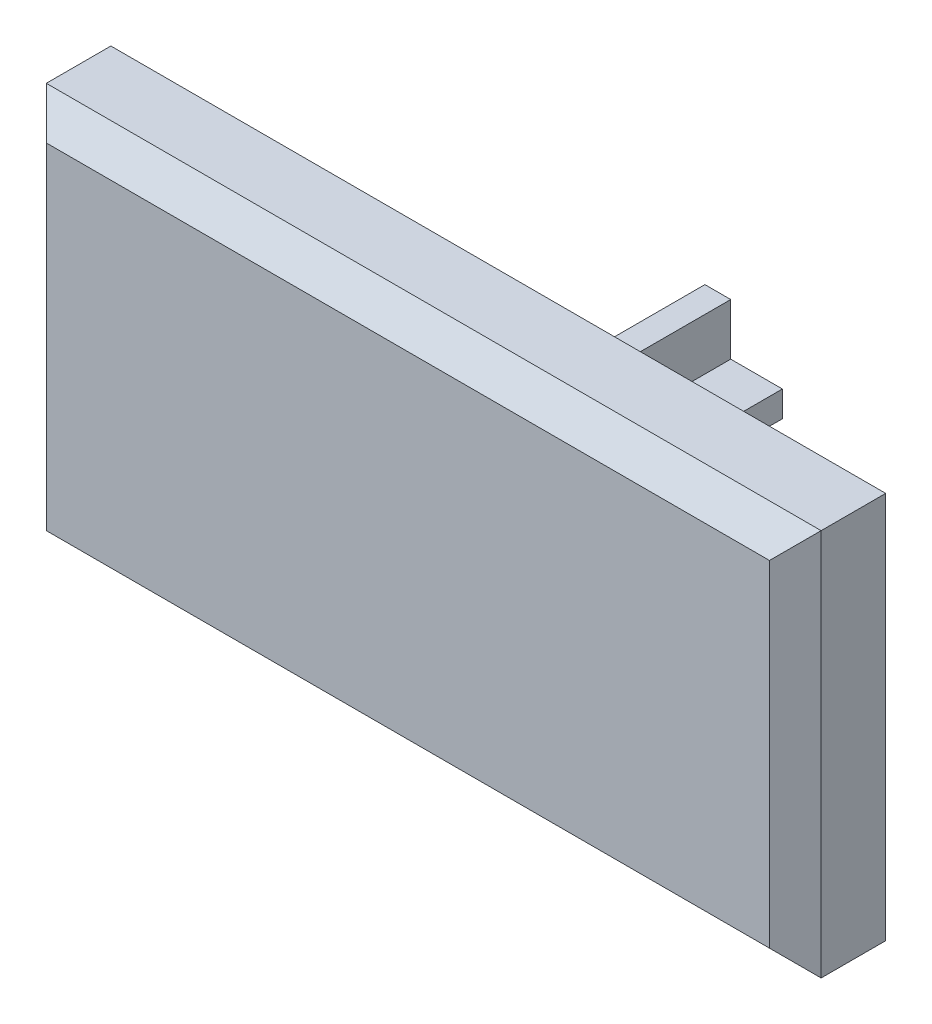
from build123d import *

# Parameters (mm, degrees)
SKETCH_1_W      = 30
SKETCH_1_H      = 15
EXTRUDE_1_DEPTH = 1.75
SHELL_1_T       = -2
CHAMFER_1_SIZE  = 1
EXTRUDE_2_DEPTH = 10


with BuildPart() as part:
    # Sketch 1 → Extrude 1 (new, symmetric)
    with BuildSketch(Plane.XY):
        Rectangle(SKETCH_1_W, SKETCH_1_H)
    extrude(amount=EXTRUDE_1_DEPTH, both=True)

    # Shell 1
    shell_1_openings = [part.faces().sort_by_distance(p)[0] for p in [
        (0, 0, -1.75),
    ]]
    offset(amount=SHELL_1_T, openings=shell_1_openings, kind=Kind.INTERSECTION)

    # Chamfer 1
    chamfer_1_edges = [part.edges().sort_by_distance(p)[0] for p in [
        (15, 0, 1.75),
        (0, 7.5, 1.75),
        (-15, 0, 1.75),
        (0, -7.5, 1.75),
    ]]
    chamfer(chamfer_1_edges, length=CHAMFER_1_SIZE)

    # Sketch 2 → Extrude 2 (add)
    with BuildSketch(Plane(origin=(0, 0, -0.25), x_dir=(-1, 0, 0), z_dir=(0, 0, -1))):
        Polygon((0.5, 0.5), (2.5, 0.5), (2.5, -0.5), (0.5, -0.5), (0.5, -2.5), (-0.5, -2.5), (-0.5, -0.5), (-2.5, -0.5), (-2.5, 0.5), (-0.5, 0.5), (-0.5, 2.5), (0.5, 2.5), align=None)
    extrude(amount=EXTRUDE_2_DEPTH)


solid = part.part
